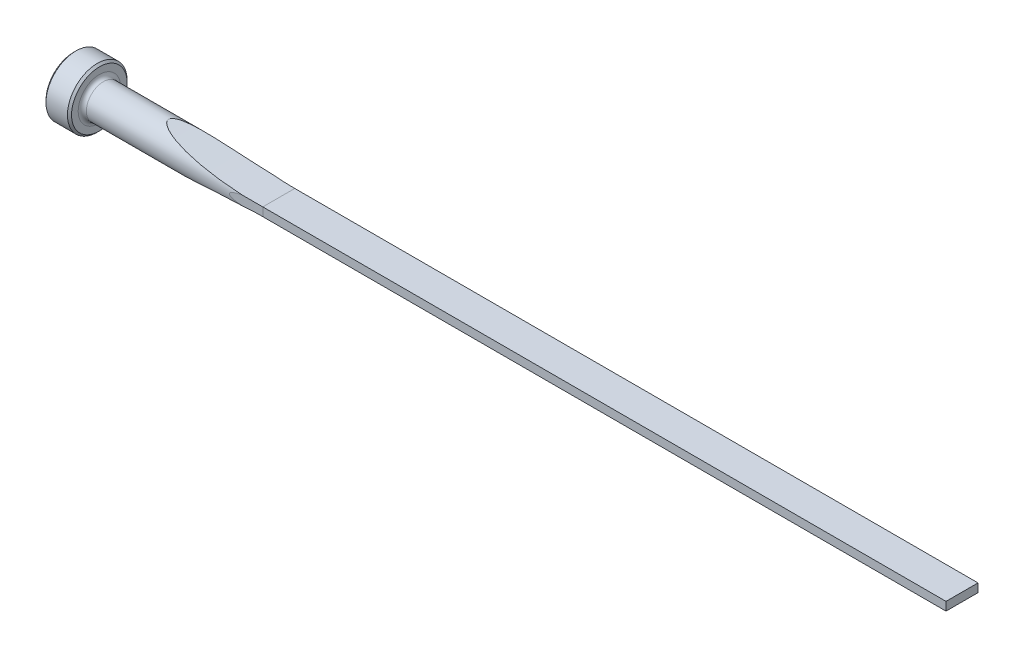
ISO-10303-21;
HEADER;
FILE_DESCRIPTION(('STEP AP214'),'2;1');
FILE_NAME('part.step','',(''),(''),'','','');
FILE_SCHEMA(('AUTOMOTIVE_DESIGN { 1 0 10303 214 1 1 1 1 }'));
ENDSEC;
DATA;
#1=APPLICATION_CONTEXT('core data for automotive mechanical design processes');
#2=APPLICATION_PROTOCOL_DEFINITION('international standard','automotive_design',2000,#1);
#3=PRODUCT_CONTEXT('',#1,'mechanical');
#4=PRODUCT('Part','Part','',(#3));
#5=PRODUCT_RELATED_PRODUCT_CATEGORY('part','',(#4));
#6=PRODUCT_DEFINITION_FORMATION('','',#4);
#7=PRODUCT_DEFINITION_CONTEXT('part definition',#1,'design');
#8=PRODUCT_DEFINITION('design','',#6,#7);
#9=PRODUCT_DEFINITION_SHAPE('','',#8);
#10=(LENGTH_UNIT() NAMED_UNIT(*) SI_UNIT(.MILLI.,.METRE.));
#11=(NAMED_UNIT(*) PLANE_ANGLE_UNIT() SI_UNIT($,.RADIAN.));
#12=(NAMED_UNIT(*) SI_UNIT($,.STERADIAN.) SOLID_ANGLE_UNIT());
#13=UNCERTAINTY_MEASURE_WITH_UNIT(LENGTH_MEASURE(1.E-05),#10,'distance_accuracy_value','');
#14=(GEOMETRIC_REPRESENTATION_CONTEXT(3) GLOBAL_UNCERTAINTY_ASSIGNED_CONTEXT((#13)) GLOBAL_UNIT_ASSIGNED_CONTEXT((#10,
#11,#12)) REPRESENTATION_CONTEXT('',''));
#15=CARTESIAN_POINT('',(0.,0.,0.));
#16=DIRECTION('',(0.,0.,1.));
#17=DIRECTION('',(1.,0.,0.));
#18=AXIS2_PLACEMENT_3D('',#15,#16,#17);
#19=CARTESIAN_POINT('',(0.,0.,0.));
#20=DIRECTION('',(-1.,0.,0.));
#21=DIRECTION('',(0.,0.,1.));
#22=AXIS2_PLACEMENT_3D('',#19,#20,#21);
#23=CYLINDRICAL_SURFACE('',#22,3.175);
#24=CARTESIAN_POINT('',(5.5118,0.,0.));
#25=DIRECTION('',(-1.,0.,0.));
#26=DIRECTION('',(0.,0.,1.));
#27=AXIS2_PLACEMENT_3D('',#24,#25,#26);
#28=CIRCLE('',#27,3.175);
#29=CARTESIAN_POINT('',(5.5118,0.,3.175));
#30=VERTEX_POINT('',#29);
#31=EDGE_CURVE('E153',#30,#30,#28,.F.);
#32=ORIENTED_EDGE('',*,*,#31,.T.);
#33=EDGE_LOOP('',(#32));
#34=FACE_BOUND('',#33,.T.);
#35=CARTESIAN_POINT('',(38.1,1.11760000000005,2.97179999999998));
#36=CARTESIAN_POINT('',(37.8357957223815,1.11753103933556,2.9717988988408));
#37=CARTESIAN_POINT('',(37.5715815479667,1.11446404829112,2.97297778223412));
#38=CARTESIAN_POINT('',(37.043191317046,1.10185346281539,2.97768913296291));
#39=CARTESIAN_POINT('',(36.7790153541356,1.09230645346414,2.98122284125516));
#40=CARTESIAN_POINT('',(36.2493837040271,1.06617269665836,2.9906669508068));
#41=CARTESIAN_POINT('',(35.983930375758,1.04954219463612,2.99659211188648));
#42=CARTESIAN_POINT('',(35.4537877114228,1.00807205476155,3.01079697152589));
#43=CARTESIAN_POINT('',(35.1890982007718,0.983234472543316,3.01907608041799));
#44=CARTESIAN_POINT('',(34.6615789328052,0.923383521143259,3.03792875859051));
#45=CARTESIAN_POINT('',(34.3987461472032,0.888396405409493,3.04849639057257));
#46=CARTESIAN_POINT('',(34.0064659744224,0.825064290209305,3.06600005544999));
#47=CARTESIAN_POINT('',(33.8761087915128,0.802161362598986,3.07210597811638));
#48=CARTESIAN_POINT('',(33.6163554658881,0.751700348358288,3.08484243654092));
#49=CARTESIAN_POINT('',(33.4869590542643,0.724143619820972,3.09147281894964));
#50=CARTESIAN_POINT('',(33.2294078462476,0.662714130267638,3.10522998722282));
#51=CARTESIAN_POINT('',(33.1012554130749,0.628831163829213,3.11235756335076));
#52=CARTESIAN_POINT('',(32.9111286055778,0.570760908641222,3.12333709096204));
#53=CARTESIAN_POINT('',(32.8480498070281,0.550175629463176,3.12704828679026));
#54=CARTESIAN_POINT('',(32.7230456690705,0.505797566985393,3.13453462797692));
#55=CARTESIAN_POINT('',(32.661119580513,0.482006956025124,3.13830972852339));
#56=CARTESIAN_POINT('',(32.5388265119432,0.429769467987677,3.1458898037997));
#57=CARTESIAN_POINT('',(32.4784713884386,0.401294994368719,3.14969481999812));
#58=CARTESIAN_POINT('',(32.361395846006,0.337410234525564,3.1571914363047));
#59=CARTESIAN_POINT('',(32.3046630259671,0.30202550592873,3.16088339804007));
#60=CARTESIAN_POINT('',(32.2318457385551,0.243613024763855,3.16568281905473));
#61=CARTESIAN_POINT('',(32.2116878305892,0.22579036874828,3.16701915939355));
#62=CARTESIAN_POINT('',(32.1741240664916,0.187442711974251,3.16952077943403));
#63=CARTESIAN_POINT('',(32.1567070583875,0.166929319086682,3.17068675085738));
#64=CARTESIAN_POINT('',(32.1335834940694,0.132884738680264,3.17224001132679));
#65=CARTESIAN_POINT('',(32.1261886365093,0.120518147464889,3.17273788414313));
#66=CARTESIAN_POINT('',(32.1132601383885,0.0948283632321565,3.1736095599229));
#67=CARTESIAN_POINT('',(32.1077252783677,0.0815058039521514,3.17398344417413));
#68=CARTESIAN_POINT('',(32.0990082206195,0.053897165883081,3.1745727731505));
#69=CARTESIAN_POINT('',(32.0958567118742,0.0396010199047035,3.17478615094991));
#70=CARTESIAN_POINT('',(32.0924789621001,0.0106696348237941,3.17501485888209));
#71=CARTESIAN_POINT('',(32.0922487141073,-0.00396511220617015,3.17503046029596));
#72=CARTESIAN_POINT('',(32.0945596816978,-0.0309283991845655,3.17487397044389));
#73=CARTESIAN_POINT('',(32.0967167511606,-0.0432925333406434,3.17472789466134));
#74=CARTESIAN_POINT('',(32.1029656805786,-0.0675187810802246,3.17430516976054));
#75=CARTESIAN_POINT('',(32.1070594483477,-0.0793803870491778,3.17402839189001));
#76=CARTESIAN_POINT('',(32.1191372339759,-0.107852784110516,3.17321302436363));
#77=CARTESIAN_POINT('',(32.1280454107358,-0.124065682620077,3.17261252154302));
#78=CARTESIAN_POINT('',(32.1482326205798,-0.154926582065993,3.17125564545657));
#79=CARTESIAN_POINT('',(32.1595181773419,-0.169570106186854,3.1704988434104));
#80=CARTESIAN_POINT('',(32.1944341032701,-0.209900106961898,3.16816531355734));
#81=CARTESIAN_POINT('',(32.2200991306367,-0.233790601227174,3.16645919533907));
#82=CARTESIAN_POINT('',(32.2742928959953,-0.277993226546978,3.1628833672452));
#83=CARTESIAN_POINT('',(32.302830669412,-0.298293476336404,3.16101314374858));
#84=CARTESIAN_POINT('',(32.3823413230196,-0.349789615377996,3.155843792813));
#85=CARTESIAN_POINT('',(32.4348887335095,-0.378519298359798,3.15247078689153));
#86=CARTESIAN_POINT('',(32.5423072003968,-0.431320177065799,3.1456765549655));
#87=CARTESIAN_POINT('',(32.5971839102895,-0.455379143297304,3.14225522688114));
#88=CARTESIAN_POINT('',(32.7085705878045,-0.500302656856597,3.13541729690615));
#89=CARTESIAN_POINT('',(32.765087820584,-0.521149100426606,3.13200082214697));
#90=CARTESIAN_POINT('',(32.8788979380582,-0.560302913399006,3.12523191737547));
#91=CARTESIAN_POINT('',(32.9361896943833,-0.578613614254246,3.12187940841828));
#92=CARTESIAN_POINT('',(33.1297297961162,-0.636913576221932,3.11074477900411));
#93=CARTESIAN_POINT('',(33.2673130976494,-0.672489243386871,3.10314401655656));
#94=CARTESIAN_POINT('',(33.5441302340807,-0.736755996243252,3.08850582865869));
#95=CARTESIAN_POINT('',(33.6833651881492,-0.765442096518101,3.0814688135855));
#96=CARTESIAN_POINT('',(33.9631295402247,-0.817784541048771,3.06799404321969));
#97=CARTESIAN_POINT('',(34.1036611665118,-0.841429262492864,3.06155769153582));
#98=CARTESIAN_POINT('',(34.3853732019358,-0.884713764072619,3.04932851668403));
#99=CARTESIAN_POINT('',(34.5265536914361,-0.904353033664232,3.04353577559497));
#100=CARTESIAN_POINT('',(34.9506897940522,-0.958348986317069,3.02714982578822));
#101=CARTESIAN_POINT('',(35.2343099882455,-0.987796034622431,3.01754551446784));
#102=CARTESIAN_POINT('',(35.802086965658,-1.03680456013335,3.00105004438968));
#103=CARTESIAN_POINT('',(36.0862426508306,-1.05637822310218,2.99415554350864));
#104=CARTESIAN_POINT('',(36.5149168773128,-1.079629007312,2.98581493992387));
#105=CARTESIAN_POINT('',(36.659256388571,-1.08638681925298,2.98335806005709));
#106=CARTESIAN_POINT('',(36.9480641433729,-1.0978849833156,2.97914616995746));
#107=CARTESIAN_POINT('',(37.0925324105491,-1.1026248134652,2.97739134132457));
#108=CARTESIAN_POINT('',(37.380840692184,-1.1101534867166,2.97459254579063));
#109=CARTESIAN_POINT('',(37.524680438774,-1.11295147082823,2.97354524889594));
#110=CARTESIAN_POINT('',(37.8123469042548,-1.11667170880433,2.97214903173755));
#111=CARTESIAN_POINT('',(37.9561736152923,-1.11759449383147,2.97179991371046));
#112=CARTESIAN_POINT('',(38.1,-1.11760000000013,2.97179999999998));
#113=B_SPLINE_CURVE_WITH_KNOTS('',3,(#35,#36,#37,#38,#39,#40,#41,#42,#43,#44,#45,#46,#47,#48,
#49,#50,#51,#52,#53,#54,#55,#56,#57,#58,#59,#60,#61,#62,#63,#64,#65,#66,#67,#68,#69,#70,#71,#72,
#73,#74,#75,#76,#77,#78,#79,#80,#81,#82,#83,#84,#85,#86,#87,#88,#89,#90,#91,#92,#93,#94,#95,#96,
#97,#98,#99,#100,#101,#102,#103,#104,#105,#106,#107,#108,#109,#110,#111,#112),.UNSPECIFIED.,.F.,
.F.,(4,2,2,2,2,2,2,2,2,2,2,2,2,2,2,2,2,2,2,2,2,2,2,2,2,2,2,2,2,2,2,2,2,2,2,2,2,2,4),(0.,
0.792608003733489,1.58563403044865,2.38363126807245,3.18142878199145,3.97718078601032,
4.37459807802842,4.77189959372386,5.16984765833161,5.36916585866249,5.56834964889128,
5.76875204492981,5.96842682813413,6.0490912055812,6.12941838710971,6.17255460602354,
6.21566248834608,6.2593164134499,6.30291045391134,6.34039079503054,6.37790813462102,
6.43311579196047,6.48847696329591,6.59320183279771,6.69826703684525,6.87774508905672,
7.05768691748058,7.23860836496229,7.41928981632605,7.84588397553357,8.27278590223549,
8.70066164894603,9.12859189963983,9.98423938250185,10.8388282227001,11.2723701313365,
11.7060241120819,12.1376226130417,12.569098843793),.UNSPECIFIED.);
#114=CARTESIAN_POINT('',(34.2853026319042,0.869282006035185,3.05368200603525));
#115=VERTEX_POINT('',#114);
#116=CARTESIAN_POINT('',(34.2853026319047,-0.869282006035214,3.05368200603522));
#117=VERTEX_POINT('',#116);
#118=EDGE_CURVE('E156',#115,#117,#113,.T.);
#119=ORIENTED_EDGE('',*,*,#118,.F.);
#120=CARTESIAN_POINT('',(38.1,0.78739999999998,3.07581310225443));
#121=CARTESIAN_POINT('',(37.8355438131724,0.787399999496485,3.07581083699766));
#122=CARTESIAN_POINT('',(37.5710891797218,0.788580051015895,3.07551132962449));
#123=CARTESIAN_POINT('',(37.0422022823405,0.793300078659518,3.07429803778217));
#124=CARTESIAN_POINT('',(36.7777700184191,0.796840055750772,3.0733842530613));
#125=CARTESIAN_POINT('',(35.9844189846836,0.811001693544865,3.0696912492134));
#126=CARTESIAN_POINT('',(35.4555630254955,0.825165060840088,3.06596036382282));
#127=CARTESIAN_POINT('',(34.3968502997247,0.862977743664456,3.05553241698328));
#128=CARTESIAN_POINT('',(33.8669944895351,0.88665153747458,3.04882769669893));
#129=CARTESIAN_POINT('',(32.8079603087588,0.943468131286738,3.03172836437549));
#130=CARTESIAN_POINT('',(32.2787818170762,0.976608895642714,3.02133454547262));
#131=CARTESIAN_POINT('',(31.2997492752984,1.04671882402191,2.99769210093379));
#132=CARTESIAN_POINT('',(30.8497861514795,1.0823884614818,2.98509669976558));
#133=CARTESIAN_POINT('',(29.9505791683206,1.16056445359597,2.9555818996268));
#134=CARTESIAN_POINT('',(29.5013353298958,1.203071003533,2.93866237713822));
#135=CARTESIAN_POINT('',(28.603288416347,1.29494318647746,2.89935313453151));
#136=CARTESIAN_POINT('',(28.1544863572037,1.34431625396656,2.8769574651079));
#137=CARTESIAN_POINT('',(27.2580959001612,1.44984136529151,2.82525115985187));
#138=CARTESIAN_POINT('',(26.8105074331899,1.50599301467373,2.79594092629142));
#139=CARTESIAN_POINT('',(25.9157511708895,1.62515896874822,2.72840404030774));
#140=CARTESIAN_POINT('',(25.4685873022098,1.68819027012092,2.69015502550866));
#141=CARTESIAN_POINT('',(24.5762278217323,1.82090442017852,2.6021747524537));
#142=CARTESIAN_POINT('',(24.1310327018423,1.8905888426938,2.55244077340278));
#143=CARTESIAN_POINT('',(23.4659910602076,1.99985162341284,2.46644191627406));
#144=CARTESIAN_POINT('',(23.2450024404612,2.03701989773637,2.43591445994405));
#145=CARTESIAN_POINT('',(22.8039601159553,2.11291046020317,2.37039160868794));
#146=CARTESIAN_POINT('',(22.5839063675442,2.1516326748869,2.33539642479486));
#147=CARTESIAN_POINT('',(22.1450648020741,2.23055506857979,2.26013733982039));
#148=CARTESIAN_POINT('',(21.9262764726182,2.27075459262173,2.21987575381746));
#149=CARTESIAN_POINT('',(21.4902406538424,2.35255542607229,2.13299737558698));
#150=CARTESIAN_POINT('',(21.2729929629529,2.39415654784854,2.0863814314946));
#151=CARTESIAN_POINT('',(20.9477545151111,2.45768704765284,2.01034767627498));
#152=CARTESIAN_POINT('',(20.8389864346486,2.4791456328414,1.98385903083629));
#153=CARTESIAN_POINT('',(20.6220867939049,2.52235662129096,1.92861783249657));
#154=CARTESIAN_POINT('',(20.5139552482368,2.54410903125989,1.89986522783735));
#155=CARTESIAN_POINT('',(20.1903801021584,2.6098257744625,1.80970323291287));
#156=CARTESIAN_POINT('',(19.9760432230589,2.65419348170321,1.74445519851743));
#157=CARTESIAN_POINT('',(19.6591981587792,2.72097915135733,1.63665429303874));
#158=CARTESIAN_POINT('',(19.55487364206,2.74316775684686,1.59927855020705));
#159=CARTESIAN_POINT('',(19.3477705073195,2.78760086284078,1.52051286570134));
#160=CARTESIAN_POINT('',(19.2449915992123,2.8098453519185,1.47912368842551));
#161=CARTESIAN_POINT('',(19.0417053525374,2.8542138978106,1.39157880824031));
#162=CARTESIAN_POINT('',(18.9411937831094,2.87633810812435,1.34543306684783));
#163=CARTESIAN_POINT('',(18.7430959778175,2.92029487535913,1.24716139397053));
#164=CARTESIAN_POINT('',(18.6455078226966,2.94212761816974,1.19503949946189));
#165=CARTESIAN_POINT('',(18.5117813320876,2.97227306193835,1.11659829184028));
#166=CARTESIAN_POINT('',(18.4738115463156,2.98085925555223,1.09349968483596));
#167=CARTESIAN_POINT('',(18.3987226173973,2.99788995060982,1.04590629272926));
#168=CARTESIAN_POINT('',(18.3616035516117,3.00633443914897,1.02141138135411));
#169=CARTESIAN_POINT('',(18.2515401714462,3.03144638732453,0.945421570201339));
#170=CARTESIAN_POINT('',(18.1801213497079,3.04784006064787,0.891554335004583));
#171=CARTESIAN_POINT('',(18.0427883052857,3.07952922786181,0.775133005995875));
#172=CARTESIAN_POINT('',(17.9769534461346,3.09480855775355,0.712479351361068));
#173=CARTESIAN_POINT('',(17.8563432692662,3.12292613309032,0.576813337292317));
#174=CARTESIAN_POINT('',(17.8015101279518,3.13577711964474,0.503858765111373));
#175=CARTESIAN_POINT('',(17.7334503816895,3.15177595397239,0.385387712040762));
#176=CARTESIAN_POINT('',(17.7130844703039,3.15657317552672,0.344236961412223));
#177=CARTESIAN_POINT('',(17.678672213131,3.16468806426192,0.25921672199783));
#178=CARTESIAN_POINT('',(17.6646188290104,3.16800737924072,0.215350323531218));
#179=CARTESIAN_POINT('',(17.6441287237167,3.1728494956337,0.12528752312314));
#180=CARTESIAN_POINT('',(17.6377647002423,3.17435514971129,0.0790731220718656));
#181=CARTESIAN_POINT('',(17.6337325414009,3.17530892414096,-0.0137573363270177));
#182=CARTESIAN_POINT('',(17.6360615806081,3.17475771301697,-0.0603732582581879));
#183=CARTESIAN_POINT('',(17.648420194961,3.17183542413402,-0.147654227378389));
#184=CARTESIAN_POINT('',(17.6576480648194,3.16965382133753,-0.188444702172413));
#185=CARTESIAN_POINT('',(17.6819667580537,3.16391143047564,-0.268119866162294));
#186=CARTESIAN_POINT('',(17.6970614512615,3.16034973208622,-0.307003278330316));
#187=CARTESIAN_POINT('',(17.741942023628,3.14977663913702,-0.403821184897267));
#188=CARTESIAN_POINT('',(17.7752036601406,3.14195464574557,-0.460042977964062));
#189=CARTESIAN_POINT('',(17.8496780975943,3.12449841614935,-0.566634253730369));
#190=CARTESIAN_POINT('',(17.8909151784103,3.11485864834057,-0.616985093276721));
#191=CARTESIAN_POINT('',(17.9763515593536,3.09496038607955,-0.709911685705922));
#192=CARTESIAN_POINT('',(18.0202749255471,3.08476245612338,-0.75275910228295));
#193=CARTESIAN_POINT('',(18.1115201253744,3.06365689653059,-0.834515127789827));
#194=CARTESIAN_POINT('',(18.1588452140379,3.05274858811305,-0.873419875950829));
#195=CARTESIAN_POINT('',(18.2560433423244,3.03043330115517,-0.947952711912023));
#196=CARTESIAN_POINT('',(18.3059217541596,3.0190252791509,-0.983573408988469));
#197=CARTESIAN_POINT('',(18.4074943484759,2.99588982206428,-1.05193545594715));
#198=CARTESIAN_POINT('',(18.4591877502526,2.98416252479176,-1.08467802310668));
#199=CARTESIAN_POINT('',(18.5974109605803,2.95293886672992,-1.16783092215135));
#200=CARTESIAN_POINT('',(18.6851310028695,2.93325796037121,-1.216190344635));
#201=CARTESIAN_POINT('',(18.8631864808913,2.89360215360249,-1.30773540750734));
#202=CARTESIAN_POINT('',(18.9535233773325,2.8736270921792,-1.35091808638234));
#203=CARTESIAN_POINT('',(19.1362397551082,2.83353099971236,-1.43311613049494));
#204=CARTESIAN_POINT('',(19.2286227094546,2.81340976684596,-1.47212362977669));
#205=CARTESIAN_POINT('',(19.4148168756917,2.77317207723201,-1.54658525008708));
#206=CARTESIAN_POINT('',(19.5086283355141,2.75305562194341,-1.58203874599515));
#207=CARTESIAN_POINT('',(19.7926824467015,2.69263186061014,-1.68424564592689));
#208=CARTESIAN_POINT('',(19.984601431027,2.65245744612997,-1.74643627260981));
#209=CARTESIAN_POINT('',(20.2744533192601,2.59279838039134,-1.83281823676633));
#210=CARTESIAN_POINT('',(20.371341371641,2.57302402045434,-1.86044719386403));
#211=CARTESIAN_POINT('',(20.5657197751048,2.53369185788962,-1.91366898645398));
#212=CARTESIAN_POINT('',(20.6632101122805,2.5141340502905,-1.93926186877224));
#213=CARTESIAN_POINT('',(20.9708756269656,2.45295213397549,-2.01698242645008));
#214=CARTESIAN_POINT('',(21.1819621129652,2.41176464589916,-2.06585236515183));
#215=CARTESIAN_POINT('',(21.6058251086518,2.33066711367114,-2.15692409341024));
#216=CARTESIAN_POINT('',(21.8186018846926,2.29075727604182,-2.19912480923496));
#217=CARTESIAN_POINT('',(22.2455328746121,2.21230068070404,-2.27803601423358));
#218=CARTESIAN_POINT('',(22.4596877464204,2.17375464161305,-2.31474364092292));
#219=CARTESIAN_POINT('',(22.8890012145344,2.09811389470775,-2.3835155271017));
#220=CARTESIAN_POINT('',(23.104159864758,2.06101926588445,-2.41557953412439));
#221=CARTESIAN_POINT('',(23.751863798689,1.95181443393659,-2.50600220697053));
#222=CARTESIAN_POINT('',(24.1856254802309,1.88196933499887,-2.55841192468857));
#223=CARTESIAN_POINT('',(25.0552081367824,1.74857514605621,-2.65135263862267));
#224=CARTESIAN_POINT('',(25.4910284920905,1.68502427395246,-2.69188700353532));
#225=CARTESIAN_POINT('',(26.3646050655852,1.56427552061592,-2.76380276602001));
#226=CARTESIAN_POINT('',(26.8023624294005,1.50708213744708,-2.7951777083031));
#227=CARTESIAN_POINT('',(27.6791511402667,1.39917293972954,-2.85072181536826));
#228=CARTESIAN_POINT('',(28.1181825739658,1.34845757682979,-2.87489047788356));
#229=CARTESIAN_POINT('',(28.996664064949,1.25361567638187,-2.91749372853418));
#230=CARTESIAN_POINT('',(29.4361128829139,1.20948085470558,-2.93593555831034));
#231=CARTESIAN_POINT('',(30.3157867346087,1.12775252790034,-2.96828666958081));
#232=CARTESIAN_POINT('',(30.7560117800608,1.09015912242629,-2.982195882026));
#233=CARTESIAN_POINT('',(31.7721267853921,1.01101466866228,-3.01010743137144));
#234=CARTESIAN_POINT('',(32.3482336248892,0.971783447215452,-3.02283110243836));
#235=CARTESIAN_POINT('',(33.5013377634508,0.904541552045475,-3.04362622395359));
#236=CARTESIAN_POINT('',(34.0783352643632,0.876533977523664,-3.05169638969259));
#237=CARTESIAN_POINT('',(35.2294207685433,0.831901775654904,-3.06416391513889));
#238=CARTESIAN_POINT('',(35.8035059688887,0.815211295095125,-3.06858255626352));
#239=CARTESIAN_POINT('',(36.6647116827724,0.798523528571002,-3.07294853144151));
#240=CARTESIAN_POINT('',(36.9517518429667,0.794352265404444,-3.07402686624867));
#241=CARTESIAN_POINT('',(37.5258606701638,0.788790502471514,-3.07545758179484));
#242=CARTESIAN_POINT('',(37.8129293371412,0.787400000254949,-3.07580996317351));
#243=CARTESIAN_POINT('',(38.1,0.787399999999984,-3.07581310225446));
#244=B_SPLINE_CURVE_WITH_KNOTS('',3,(#120,#121,#122,#123,#124,#125,#126,#127,#128,#129,#130,
#131,#132,#133,#134,#135,#136,#137,#138,#139,#140,#141,#142,#143,#144,#145,#146,#147,#148,#149,
#150,#151,#152,#153,#154,#155,#156,#157,#158,#159,#160,#161,#162,#163,#164,#165,#166,#167,#168,
#169,#170,#171,#172,#173,#174,#175,#176,#177,#178,#179,#180,#181,#182,#183,#184,#185,#186,#187,
#188,#189,#190,#191,#192,#193,#194,#195,#196,#197,#198,#199,#200,#201,#202,#203,#204,#205,#206,
#207,#208,#209,#210,#211,#212,#213,#214,#215,#216,#217,#218,#219,#220,#221,#222,#223,#224,#225,
#226,#227,#228,#229,#230,#231,#232,#233,#234,#235,#236,#237,#238,#239,#240,#241,#242,#243),
.UNSPECIFIED.,.F.,.F.,(4,2,2,2,2,2,2,2,2,2,2,2,2,2,2,2,2,2,2,2,2,2,2,2,2,2,2,2,2,2,2,2,2,2,2,2,
2,2,2,2,2,2,2,2,2,2,2,2,2,2,2,2,2,2,2,2,2,2,2,2,2,4),(0.,0.793362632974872,1.58672559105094,
3.17380261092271,4.76499095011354,6.35583739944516,7.71042211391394,9.0650455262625,
10.4211471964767,11.7771699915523,13.1366222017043,14.4963967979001,15.1748434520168,
15.8532580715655,16.5313754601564,17.2094024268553,17.5513342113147,17.8932738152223,
18.5780521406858,18.9170442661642,19.2559719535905,19.5942037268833,19.9322083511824,
20.0679784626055,20.2037608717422,20.4761399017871,20.7519011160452,21.0261726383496,
21.1642406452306,21.302154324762,21.4413619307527,21.5805242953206,21.705627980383,
21.8308143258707,22.0270516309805,22.2238960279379,22.4102246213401,22.5967339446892,
22.7836532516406,22.9704931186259,23.2765002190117,23.5826815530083,23.8894299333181,
24.1962321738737,24.8129775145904,25.1209844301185,25.4289842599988,26.0904791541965,
26.7520804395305,27.4140252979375,28.07600613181,29.40309776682,30.7298125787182,
32.0574601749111,33.3852002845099,34.7112545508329,36.0373290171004,37.769931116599,
39.5030113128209,41.2259182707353,42.087123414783,42.9483278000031),.UNSPECIFIED.);
#245=CARTESIAN_POINT('',(34.2853026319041,0.869282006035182,-3.05368200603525));
#246=VERTEX_POINT('',#245);
#247=EDGE_CURVE('E106',#115,#246,#244,.T.);
#248=ORIENTED_EDGE('',*,*,#247,.T.);
#249=CARTESIAN_POINT('',(38.1,1.11760000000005,-2.97179999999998));
#250=CARTESIAN_POINT('',(37.8357957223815,1.11753103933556,-2.9717988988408));
#251=CARTESIAN_POINT('',(37.5715815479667,1.11446404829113,-2.97297778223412));
#252=CARTESIAN_POINT('',(37.043191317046,1.10185346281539,-2.97768913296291));
#253=CARTESIAN_POINT('',(36.7790153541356,1.09230645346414,-2.98122284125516));
#254=CARTESIAN_POINT('',(36.2493837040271,1.06617269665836,-2.9906669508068));
#255=CARTESIAN_POINT('',(35.983930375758,1.04954219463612,-2.99659211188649));
#256=CARTESIAN_POINT('',(35.4537877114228,1.00807205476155,-3.01079697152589));
#257=CARTESIAN_POINT('',(35.1890982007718,0.983234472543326,-3.01907608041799));
#258=CARTESIAN_POINT('',(34.6615789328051,0.923383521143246,-3.03792875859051));
#259=CARTESIAN_POINT('',(34.3987461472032,0.888396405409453,-3.04849639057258));
#260=CARTESIAN_POINT('',(34.0064659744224,0.825064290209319,-3.06600005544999));
#261=CARTESIAN_POINT('',(33.8761087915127,0.802161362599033,-3.07210597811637));
#262=CARTESIAN_POINT('',(33.616355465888,0.751700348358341,-3.08484243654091));
#263=CARTESIAN_POINT('',(33.4869590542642,0.724143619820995,-3.09147281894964));
#264=CARTESIAN_POINT('',(33.2294078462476,0.662714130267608,-3.10522998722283));
#265=CARTESIAN_POINT('',(33.1012554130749,0.628831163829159,-3.11235756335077));
#266=CARTESIAN_POINT('',(32.9111286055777,0.57076090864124,-3.12333709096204));
#267=CARTESIAN_POINT('',(32.8480498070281,0.550175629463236,-3.12704828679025));
#268=CARTESIAN_POINT('',(32.7230456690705,0.50579756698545,-3.13453462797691));
#269=CARTESIAN_POINT('',(32.661119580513,0.482006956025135,-3.13830972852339));
#270=CARTESIAN_POINT('',(32.5388265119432,0.429769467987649,-3.14588980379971));
#271=CARTESIAN_POINT('',(32.4784713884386,0.401294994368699,-3.14969481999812));
#272=CARTESIAN_POINT('',(32.361395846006,0.337410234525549,-3.1571914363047));
#273=CARTESIAN_POINT('',(32.3046630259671,0.302025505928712,-3.16088339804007));
#274=CARTESIAN_POINT('',(32.2318457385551,0.243613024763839,-3.16568281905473));
#275=CARTESIAN_POINT('',(32.2116878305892,0.225790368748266,-3.16701915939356));
#276=CARTESIAN_POINT('',(32.1741240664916,0.187442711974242,-3.16952077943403));
#277=CARTESIAN_POINT('',(32.1567070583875,0.166929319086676,-3.17068675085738));
#278=CARTESIAN_POINT('',(32.1335834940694,0.132884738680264,-3.17224001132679));
#279=CARTESIAN_POINT('',(32.1261886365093,0.120518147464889,-3.17273788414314));
#280=CARTESIAN_POINT('',(32.1132601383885,0.0948283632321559,-3.1736095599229));
#281=CARTESIAN_POINT('',(32.1077252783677,0.0815058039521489,-3.17398344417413));
#282=CARTESIAN_POINT('',(32.0990082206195,0.0538971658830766,-3.1745727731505));
#283=CARTESIAN_POINT('',(32.0958567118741,0.0396010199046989,-3.17478615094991));
#284=CARTESIAN_POINT('',(32.0924789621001,0.0106696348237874,-3.17501485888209));
#285=CARTESIAN_POINT('',(32.0922487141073,-0.00396511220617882,-3.17503046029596));
#286=CARTESIAN_POINT('',(32.0945596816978,-0.0309283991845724,-3.17487397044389));
#287=CARTESIAN_POINT('',(32.0967167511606,-0.043292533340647,-3.17472789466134));
#288=CARTESIAN_POINT('',(32.1029656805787,-0.0675187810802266,-3.17430516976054));
#289=CARTESIAN_POINT('',(32.1070594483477,-0.0793803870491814,-3.17402839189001));
#290=CARTESIAN_POINT('',(32.1191372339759,-0.107852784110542,-3.17321302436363));
#291=CARTESIAN_POINT('',(32.1280454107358,-0.124065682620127,-3.17261252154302));
#292=CARTESIAN_POINT('',(32.1482326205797,-0.154926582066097,-3.17125564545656));
#293=CARTESIAN_POINT('',(32.1595181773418,-0.169570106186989,-3.17049884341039));
#294=CARTESIAN_POINT('',(32.19443410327,-0.209900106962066,-3.16816531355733));
#295=CARTESIAN_POINT('',(32.2200991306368,-0.233790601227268,-3.16645919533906));
#296=CARTESIAN_POINT('',(32.2742928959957,-0.277993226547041,-3.16288336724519));
#297=CARTESIAN_POINT('',(32.3028306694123,-0.298293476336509,-3.16101314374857));
#298=CARTESIAN_POINT('',(32.3823413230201,-0.349789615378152,-3.15584379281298));
#299=CARTESIAN_POINT('',(32.4348887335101,-0.378519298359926,-3.15247078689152));
#300=CARTESIAN_POINT('',(32.5423072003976,-0.431320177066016,-3.14567655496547));
#301=CARTESIAN_POINT('',(32.5971839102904,-0.455379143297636,-3.14225522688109));
#302=CARTESIAN_POINT('',(32.7085705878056,-0.500302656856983,-3.13541729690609));
#303=CARTESIAN_POINT('',(32.7650878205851,-0.52114910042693,-3.13200082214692));
#304=CARTESIAN_POINT('',(32.8788979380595,-0.56030291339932,-3.12523191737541));
#305=CARTESIAN_POINT('',(32.9361896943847,-0.578613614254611,-3.12187940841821));
#306=CARTESIAN_POINT('',(33.1297297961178,-0.63691357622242,-3.11074477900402));
#307=CARTESIAN_POINT('',(33.2673130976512,-0.672489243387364,-3.10314401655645));
#308=CARTESIAN_POINT('',(33.5441302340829,-0.73675599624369,-3.08850582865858));
#309=CARTESIAN_POINT('',(33.6833651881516,-0.765442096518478,-3.08146881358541));
#310=CARTESIAN_POINT('',(33.9631295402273,-0.817784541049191,-3.06799404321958));
#311=CARTESIAN_POINT('',(34.1036611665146,-0.841429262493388,-3.06155769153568));
#312=CARTESIAN_POINT('',(34.3853732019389,-0.884713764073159,-3.04932851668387));
#313=CARTESIAN_POINT('',(34.5265536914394,-0.904353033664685,-3.04353577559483));
#314=CARTESIAN_POINT('',(34.9506897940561,-0.958348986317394,-3.02714982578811));
#315=CARTESIAN_POINT('',(35.2343099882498,-0.987796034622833,-3.01754551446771));
#316=CARTESIAN_POINT('',(35.8020869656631,-1.0368045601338,-3.00105004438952));
#317=CARTESIAN_POINT('',(36.0862426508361,-1.05637822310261,-2.99415554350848));
#318=CARTESIAN_POINT('',(36.5149168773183,-1.0796290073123,-2.98581493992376));
#319=CARTESIAN_POINT('',(36.659256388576,-1.0863868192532,-2.98335806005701));
#320=CARTESIAN_POINT('',(36.948064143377,-1.09788498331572,-2.97914616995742));
#321=CARTESIAN_POINT('',(37.0925324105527,-1.10262481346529,-2.97739134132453));
#322=CARTESIAN_POINT('',(37.3808406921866,-1.11015348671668,-2.9745925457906));
#323=CARTESIAN_POINT('',(37.524680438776,-1.11295147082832,-2.97354524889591));
#324=CARTESIAN_POINT('',(37.8123469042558,-1.11667170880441,-2.97214903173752));
#325=CARTESIAN_POINT('',(37.9561736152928,-1.11759449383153,-2.97179991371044));
#326=CARTESIAN_POINT('',(38.1,-1.11760000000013,-2.97179999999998));
#327=B_SPLINE_CURVE_WITH_KNOTS('',3,(#249,#250,#251,#252,#253,#254,#255,#256,#257,#258,#259,
#260,#261,#262,#263,#264,#265,#266,#267,#268,#269,#270,#271,#272,#273,#274,#275,#276,#277,#278,
#279,#280,#281,#282,#283,#284,#285,#286,#287,#288,#289,#290,#291,#292,#293,#294,#295,#296,#297,
#298,#299,#300,#301,#302,#303,#304,#305,#306,#307,#308,#309,#310,#311,#312,#313,#314,#315,#316,
#317,#318,#319,#320,#321,#322,#323,#324,#325,#326),.UNSPECIFIED.,.F.,.F.,(4,2,2,2,2,2,2,2,2,2,2,
2,2,2,2,2,2,2,2,2,2,2,2,2,2,2,2,2,2,2,2,2,2,2,2,2,2,2,4),(0.,0.792608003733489,1.58563403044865,
2.38363126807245,3.18142878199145,3.97718078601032,4.37459807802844,4.77189959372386,
5.16984765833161,5.36916585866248,5.56834964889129,5.76875204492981,5.96842682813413,
6.04909120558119,6.12941838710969,6.17255460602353,6.21566248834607,6.25931641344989,
6.30291045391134,6.34039079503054,6.37790813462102,6.43311579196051,6.48847696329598,
6.59320183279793,6.69826703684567,6.87774508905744,7.05768691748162,7.23860836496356,
7.41928981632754,7.84588397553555,8.27278590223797,8.700661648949,9.12859189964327,
9.98423938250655,10.838828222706,11.272370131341,11.706024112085,12.1376226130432,
12.569098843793),.UNSPECIFIED.);
#328=CARTESIAN_POINT('',(34.2853026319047,-0.869282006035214,-3.05368200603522));
#329=VERTEX_POINT('',#328);
#330=EDGE_CURVE('E175',#246,#329,#327,.T.);
#331=ORIENTED_EDGE('',*,*,#330,.T.);
#332=CARTESIAN_POINT('',(38.1,-0.78739999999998,3.07581310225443));
#333=CARTESIAN_POINT('',(37.8355438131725,-0.787399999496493,3.07581083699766));
#334=CARTESIAN_POINT('',(37.5710891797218,-0.788580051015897,3.07551132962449));
#335=CARTESIAN_POINT('',(37.0422022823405,-0.793300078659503,3.07429803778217));
#336=CARTESIAN_POINT('',(36.7777700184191,-0.796840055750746,3.07338425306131));
#337=CARTESIAN_POINT('',(35.9844189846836,-0.811001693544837,3.06969124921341));
#338=CARTESIAN_POINT('',(35.4555630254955,-0.825165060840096,3.06596036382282));
#339=CARTESIAN_POINT('',(34.3968502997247,-0.862977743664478,3.05553241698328));
#340=CARTESIAN_POINT('',(33.8669944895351,-0.88665153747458,3.04882769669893));
#341=CARTESIAN_POINT('',(32.8079603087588,-0.943468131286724,3.03172836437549));
#342=CARTESIAN_POINT('',(32.2787818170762,-0.976608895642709,3.02133454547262));
#343=CARTESIAN_POINT('',(31.2997492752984,-1.04671882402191,2.99769210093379));
#344=CARTESIAN_POINT('',(30.8497861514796,-1.0823884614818,2.98509669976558));
#345=CARTESIAN_POINT('',(29.9505791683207,-1.16056445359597,2.9555818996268));
#346=CARTESIAN_POINT('',(29.5013353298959,-1.203071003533,2.93866237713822));
#347=CARTESIAN_POINT('',(28.603288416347,-1.29494318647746,2.89935313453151));
#348=CARTESIAN_POINT('',(28.1544863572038,-1.34431625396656,2.8769574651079));
#349=CARTESIAN_POINT('',(27.2580959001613,-1.44984136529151,2.82525115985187));
#350=CARTESIAN_POINT('',(26.8105074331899,-1.50599301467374,2.79594092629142));
#351=CARTESIAN_POINT('',(25.9157511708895,-1.62515896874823,2.72840404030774));
#352=CARTESIAN_POINT('',(25.4685873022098,-1.68819027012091,2.69015502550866));
#353=CARTESIAN_POINT('',(24.5762278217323,-1.82090442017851,2.6021747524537));
#354=CARTESIAN_POINT('',(24.1310327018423,-1.89058884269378,2.55244077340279));
#355=CARTESIAN_POINT('',(23.4659910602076,-1.99985162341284,2.46644191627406));
#356=CARTESIAN_POINT('',(23.2450024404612,-2.03701989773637,2.43591445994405));
#357=CARTESIAN_POINT('',(22.8039601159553,-2.11291046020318,2.37039160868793));
#358=CARTESIAN_POINT('',(22.5839063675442,-2.15163267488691,2.33539642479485));
#359=CARTESIAN_POINT('',(22.1450648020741,-2.2305550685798,2.26013733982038));
#360=CARTESIAN_POINT('',(21.9262764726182,-2.27075459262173,2.21987575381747));
#361=CARTESIAN_POINT('',(21.4902406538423,-2.35255542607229,2.13299737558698));
#362=CARTESIAN_POINT('',(21.2729929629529,-2.39415654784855,2.08638143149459));
#363=CARTESIAN_POINT('',(20.9477545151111,-2.45768704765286,2.01034767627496));
#364=CARTESIAN_POINT('',(20.8389864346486,-2.47914563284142,1.98385903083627));
#365=CARTESIAN_POINT('',(20.6220867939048,-2.52235662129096,1.92861783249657));
#366=CARTESIAN_POINT('',(20.5139552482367,-2.54410903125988,1.89986522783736));
#367=CARTESIAN_POINT('',(20.1903801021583,-2.60982577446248,1.80970323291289));
#368=CARTESIAN_POINT('',(19.9760432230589,-2.65419348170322,1.74445519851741));
#369=CARTESIAN_POINT('',(19.6591981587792,-2.72097915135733,1.63665429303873));
#370=CARTESIAN_POINT('',(19.55487364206,-2.74316775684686,1.59927855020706));
#371=CARTESIAN_POINT('',(19.3477705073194,-2.78760086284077,1.52051286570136));
#372=CARTESIAN_POINT('',(19.2449915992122,-2.80984535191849,1.47912368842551));
#373=CARTESIAN_POINT('',(19.0417053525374,-2.8542138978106,1.3915788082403));
#374=CARTESIAN_POINT('',(18.9411937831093,-2.87633810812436,1.34543306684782));
#375=CARTESIAN_POINT('',(18.7430959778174,-2.92029487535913,1.24716139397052));
#376=CARTESIAN_POINT('',(18.6455078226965,-2.94212761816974,1.19503949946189));
#377=CARTESIAN_POINT('',(18.5117813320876,-2.97227306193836,1.11659829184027));
#378=CARTESIAN_POINT('',(18.4738115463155,-2.98085925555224,1.09349968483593));
#379=CARTESIAN_POINT('',(18.3987226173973,-2.99788995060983,1.04590629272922));
#380=CARTESIAN_POINT('',(18.3616035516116,-3.00633443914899,1.02141138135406));
#381=CARTESIAN_POINT('',(18.2515401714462,-3.03144638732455,0.94542157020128));
#382=CARTESIAN_POINT('',(18.1801213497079,-3.04784006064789,0.891554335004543));
#383=CARTESIAN_POINT('',(18.0427883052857,-3.07952922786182,0.775133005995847));
#384=CARTESIAN_POINT('',(17.9769534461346,-3.09480855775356,0.712479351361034));
#385=CARTESIAN_POINT('',(17.8563432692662,-3.12292613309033,0.576813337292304));
#386=CARTESIAN_POINT('',(17.8015101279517,-3.13577711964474,0.503858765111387));
#387=CARTESIAN_POINT('',(17.7334503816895,-3.15177595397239,0.385387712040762));
#388=CARTESIAN_POINT('',(17.7130844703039,-3.15657317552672,0.344236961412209));
#389=CARTESIAN_POINT('',(17.678672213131,-3.16468806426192,0.259216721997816));
#390=CARTESIAN_POINT('',(17.6646188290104,-3.16800737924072,0.215350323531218));
#391=CARTESIAN_POINT('',(17.6441287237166,-3.1728494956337,0.125287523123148));
#392=CARTESIAN_POINT('',(17.6377647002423,-3.17435514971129,0.0790731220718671));
#393=CARTESIAN_POINT('',(17.633732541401,-3.17530892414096,-0.0137573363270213));
#394=CARTESIAN_POINT('',(17.6360615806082,-3.17475771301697,-0.0603732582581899));
#395=CARTESIAN_POINT('',(17.648420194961,-3.17183542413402,-0.147654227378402));
#396=CARTESIAN_POINT('',(17.6576480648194,-3.16965382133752,-0.188444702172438));
#397=CARTESIAN_POINT('',(17.6819667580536,-3.16391143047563,-0.268119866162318));
#398=CARTESIAN_POINT('',(17.6970614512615,-3.16034973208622,-0.307003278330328));
#399=CARTESIAN_POINT('',(17.741942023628,-3.14977663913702,-0.403821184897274));
#400=CARTESIAN_POINT('',(17.7752036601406,-3.14195464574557,-0.46004297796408));
#401=CARTESIAN_POINT('',(17.8496780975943,-3.12449841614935,-0.566634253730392));
#402=CARTESIAN_POINT('',(17.8909151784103,-3.11485864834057,-0.616985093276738));
#403=CARTESIAN_POINT('',(17.9763515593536,-3.09496038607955,-0.709911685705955));
#404=CARTESIAN_POINT('',(18.0202749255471,-3.08476245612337,-0.752759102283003));
#405=CARTESIAN_POINT('',(18.1115201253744,-3.06365689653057,-0.834515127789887));
#406=CARTESIAN_POINT('',(18.1588452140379,-3.05274858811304,-0.873419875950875));
#407=CARTESIAN_POINT('',(18.2560433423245,-3.03043330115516,-0.947952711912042));
#408=CARTESIAN_POINT('',(18.3059217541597,-3.0190252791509,-0.983573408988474));
#409=CARTESIAN_POINT('',(18.407494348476,-2.99588982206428,-1.05193545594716));
#410=CARTESIAN_POINT('',(18.4591877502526,-2.98416252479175,-1.08467802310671));
#411=CARTESIAN_POINT('',(18.5974109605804,-2.9529388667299,-1.16783092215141));
#412=CARTESIAN_POINT('',(18.6851310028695,-2.93325796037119,-1.21619034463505));
#413=CARTESIAN_POINT('',(18.8631864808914,-2.89360215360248,-1.30773540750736));
#414=CARTESIAN_POINT('',(18.9535233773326,-2.8736270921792,-1.35091808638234));
#415=CARTESIAN_POINT('',(19.1362397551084,-2.83353099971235,-1.43311613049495));
#416=CARTESIAN_POINT('',(19.2286227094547,-2.81340976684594,-1.47212362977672));
#417=CARTESIAN_POINT('',(19.4148168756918,-2.77317207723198,-1.54658525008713));
#418=CARTESIAN_POINT('',(19.5086283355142,-2.75305562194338,-1.5820387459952));
#419=CARTESIAN_POINT('',(19.7926824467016,-2.6926318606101,-1.68424564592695));
#420=CARTESIAN_POINT('',(19.9846014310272,-2.65245744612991,-1.7464362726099));
#421=CARTESIAN_POINT('',(20.2744533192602,-2.59279838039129,-1.83281823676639));
#422=CARTESIAN_POINT('',(20.3713413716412,-2.5730240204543,-1.86044719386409));
#423=CARTESIAN_POINT('',(20.565719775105,-2.53369185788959,-1.91366898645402));
#424=CARTESIAN_POINT('',(20.6632101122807,-2.51413405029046,-1.93926186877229));
#425=CARTESIAN_POINT('',(20.9708756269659,-2.45295213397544,-2.01698242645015));
#426=CARTESIAN_POINT('',(21.1819621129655,-2.4117646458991,-2.0658523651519));
#427=CARTESIAN_POINT('',(21.6058251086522,-2.33066711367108,-2.15692409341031));
#428=CARTESIAN_POINT('',(21.8186018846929,-2.29075727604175,-2.19912480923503));
#429=CARTESIAN_POINT('',(22.2455328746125,-2.21230068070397,-2.27803601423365));
#430=CARTESIAN_POINT('',(22.4596877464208,-2.17375464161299,-2.31474364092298));
#431=CARTESIAN_POINT('',(22.8890012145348,-2.09811389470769,-2.38351552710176));
#432=CARTESIAN_POINT('',(23.1041598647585,-2.06101926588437,-2.41557953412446));
#433=CARTESIAN_POINT('',(23.7518637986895,-1.95181443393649,-2.50600220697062));
#434=CARTESIAN_POINT('',(24.1856254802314,-1.88196933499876,-2.55841192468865));
#435=CARTESIAN_POINT('',(25.0552081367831,-1.7485751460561,-2.65135263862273));
#436=CARTESIAN_POINT('',(25.4910284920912,-1.68502427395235,-2.69188700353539));
#437=CARTESIAN_POINT('',(26.364605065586,-1.56427552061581,-2.76380276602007));
#438=CARTESIAN_POINT('',(26.8023624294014,-1.50708213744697,-2.79517770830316));
#439=CARTESIAN_POINT('',(27.6791511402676,-1.39917293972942,-2.85072181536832));
#440=CARTESIAN_POINT('',(28.1181825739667,-1.34845757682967,-2.87489047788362));
#441=CARTESIAN_POINT('',(28.99666406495,-1.25361567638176,-2.91749372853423));
#442=CARTESIAN_POINT('',(29.436112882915,-1.20948085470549,-2.93593555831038));
#443=CARTESIAN_POINT('',(30.3157867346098,-1.12775252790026,-2.96828666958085));
#444=CARTESIAN_POINT('',(30.756011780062,-1.09015912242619,-2.98219588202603));
#445=CARTESIAN_POINT('',(31.7721267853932,-1.01101466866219,-3.01010743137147));
#446=CARTESIAN_POINT('',(32.3482336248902,-0.971783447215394,-3.02283110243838));
#447=CARTESIAN_POINT('',(33.5013377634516,-0.904541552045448,-3.04362622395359));
#448=CARTESIAN_POINT('',(34.0783352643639,-0.876533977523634,-3.0516963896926));
#449=CARTESIAN_POINT('',(35.2294207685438,-0.831901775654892,-3.06416391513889));
#450=CARTESIAN_POINT('',(35.8035059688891,-0.815211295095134,-3.06858255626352));
#451=CARTESIAN_POINT('',(36.6647116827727,-0.798523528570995,-3.07294853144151));
#452=CARTESIAN_POINT('',(36.9517518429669,-0.794352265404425,-3.07402686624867));
#453=CARTESIAN_POINT('',(37.5258606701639,-0.788790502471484,-3.07545758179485));
#454=CARTESIAN_POINT('',(37.8129293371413,-0.787400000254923,-3.07580996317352));
#455=CARTESIAN_POINT('',(38.1,-0.787399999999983,-3.07581310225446));
#456=B_SPLINE_CURVE_WITH_KNOTS('',3,(#332,#333,#334,#335,#336,#337,#338,#339,#340,#341,#342,
#343,#344,#345,#346,#347,#348,#349,#350,#351,#352,#353,#354,#355,#356,#357,#358,#359,#360,#361,
#362,#363,#364,#365,#366,#367,#368,#369,#370,#371,#372,#373,#374,#375,#376,#377,#378,#379,#380,
#381,#382,#383,#384,#385,#386,#387,#388,#389,#390,#391,#392,#393,#394,#395,#396,#397,#398,#399,
#400,#401,#402,#403,#404,#405,#406,#407,#408,#409,#410,#411,#412,#413,#414,#415,#416,#417,#418,
#419,#420,#421,#422,#423,#424,#425,#426,#427,#428,#429,#430,#431,#432,#433,#434,#435,#436,#437,
#438,#439,#440,#441,#442,#443,#444,#445,#446,#447,#448,#449,#450,#451,#452,#453,#454,#455),
.UNSPECIFIED.,.F.,.F.,(4,2,2,2,2,2,2,2,2,2,2,2,2,2,2,2,2,2,2,2,2,2,2,2,2,2,2,2,2,2,2,2,2,2,2,2,
2,2,2,2,2,2,2,2,2,2,2,2,2,2,2,2,2,2,2,2,2,2,2,2,2,4),(0.,0.793362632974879,1.58672559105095,
3.17380261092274,4.76499095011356,6.35583739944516,7.71042211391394,9.0650455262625,
10.4211471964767,11.7771699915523,13.1366222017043,14.4963967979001,15.1748434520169,
15.8532580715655,16.5313754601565,17.2094024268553,17.5513342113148,17.8932738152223,
18.5780521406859,18.9170442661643,19.2559719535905,19.5942037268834,19.9322083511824,
20.0679784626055,20.2037608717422,20.4761399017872,20.7519011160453,21.0261726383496,
21.1642406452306,21.302154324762,21.4413619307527,21.5805242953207,21.705627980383,
21.8308143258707,22.0270516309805,22.223896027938,22.4102246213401,22.5967339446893,
22.7836532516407,22.970493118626,23.2765002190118,23.5826815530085,23.8894299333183,
24.1962321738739,24.8129775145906,25.1209844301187,25.4289842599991,26.0904791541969,
26.752080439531,27.414025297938,28.0760061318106,29.4030977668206,30.729812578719,
32.0574601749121,33.3852002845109,34.711254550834,36.0373290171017,37.7699311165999,
39.5030113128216,41.2259182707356,42.0871234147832,42.9483278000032),.UNSPECIFIED.);
#457=EDGE_CURVE('E105',#117,#329,#456,.T.);
#458=ORIENTED_EDGE('',*,*,#457,.F.);
#459=EDGE_LOOP('',(#119,#248,#331,#458));
#460=FACE_BOUND('',#459,.T.);
#461=ADVANCED_FACE('F33',(#34,#460),#23,.T.);
#462=CARTESIAN_POINT('',(165.1,3.175,0.));
#463=DIRECTION('',(-1.,0.,0.));
#464=DIRECTION('',(0.,0.,1.));
#465=AXIS2_PLACEMENT_3D('',#462,#463,#464);
#466=PLANE('',#465);
#467=DIRECTION('',(0.,1.,0.));
#468=VECTOR('',#467,1.);
#469=CARTESIAN_POINT('',(165.1,-5.5499,2.9718));
#470=LINE('',#469,#468);
#471=CARTESIAN_POINT('',(165.1,-0.7874,2.9718));
#472=VERTEX_POINT('',#471);
#473=CARTESIAN_POINT('',(165.1,0.7874,2.9718));
#474=VERTEX_POINT('',#473);
#475=EDGE_CURVE('E87',#472,#474,#470,.T.);
#476=ORIENTED_EDGE('',*,*,#475,.F.);
#477=DIRECTION('',(0.,0.,1.));
#478=VECTOR('',#477,1.);
#479=CARTESIAN_POINT('',(165.1,-0.7874,0.));
#480=LINE('',#479,#478);
#481=CARTESIAN_POINT('',(165.1,-0.7874,-2.97179999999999));
#482=VERTEX_POINT('',#481);
#483=EDGE_CURVE('E100',#482,#472,#480,.T.);
#484=ORIENTED_EDGE('',*,*,#483,.F.);
#485=DIRECTION('',(0.,1.,0.));
#486=VECTOR('',#485,1.);
#487=CARTESIAN_POINT('',(165.1,-5.5499,-2.9718));
#488=LINE('',#487,#486);
#489=CARTESIAN_POINT('',(165.1,0.787399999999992,-2.9718));
#490=VERTEX_POINT('',#489);
#491=EDGE_CURVE('E56',#482,#490,#488,.T.);
#492=ORIENTED_EDGE('',*,*,#491,.T.);
#493=DIRECTION('',(0.,0.,1.));
#494=VECTOR('',#493,1.);
#495=CARTESIAN_POINT('',(165.1,0.7874,0.));
#496=LINE('',#495,#494);
#497=EDGE_CURVE('E102',#490,#474,#496,.T.);
#498=ORIENTED_EDGE('',*,*,#497,.T.);
#499=EDGE_LOOP('',(#476,#484,#492,#498));
#500=FACE_BOUND('',#499,.T.);
#501=ADVANCED_FACE('F99',(#500),#466,.F.);
#502=CARTESIAN_POINT('',(38.1,89.6874,-5.5499));
#503=DIRECTION('',(0.,0.,1.));
#504=DIRECTION('',(1.,0.,0.));
#505=AXIS2_PLACEMENT_3D('',#502,#503,#504);
#506=CYLINDRICAL_SURFACE('',#505,88.9);
#507=CARTESIAN_POINT('',(38.1,89.6874,91.8718));
#508=DIRECTION('',(0.,-0.707106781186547,0.707106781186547));
#509=DIRECTION('',(0.,0.707106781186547,0.707106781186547));
#510=AXIS2_PLACEMENT_3D('',#507,#508,#509);
#511=ELLIPSE('',#510,125.723585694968,88.9);
#512=CARTESIAN_POINT('',(38.1,0.787399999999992,2.97179999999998));
#513=VERTEX_POINT('',#512);
#514=EDGE_CURVE('E162',#513,#115,#511,.F.);
#515=ORIENTED_EDGE('',*,*,#514,.F.);
#516=DIRECTION('',(0.,0.,1.));
#517=VECTOR('',#516,1.);
#518=CARTESIAN_POINT('',(38.1,0.787399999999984,-5.5499));
#519=LINE('',#518,#517);
#520=CARTESIAN_POINT('',(38.1,0.787399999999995,-2.97179999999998));
#521=VERTEX_POINT('',#520);
#522=EDGE_CURVE('E170',#521,#513,#519,.T.);
#523=ORIENTED_EDGE('',*,*,#522,.F.);
#524=CARTESIAN_POINT('',(38.1,89.6874,-91.8718));
#525=DIRECTION('',(0.,0.707106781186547,0.707106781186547));
#526=DIRECTION('',(0.,-0.707106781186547,0.707106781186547));
#527=AXIS2_PLACEMENT_3D('',#524,#525,#526);
#528=ELLIPSE('',#527,125.723585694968,88.9);
#529=EDGE_CURVE('E169',#521,#246,#528,.F.);
#530=ORIENTED_EDGE('',*,*,#529,.T.);
#531=ORIENTED_EDGE('',*,*,#247,.F.);
#532=EDGE_LOOP('',(#515,#523,#530,#531));
#533=FACE_BOUND('',#532,.T.);
#534=ADVANCED_FACE('F138',(#533),#506,.F.);
#535=CARTESIAN_POINT('',(165.1,0.7874,-5.5499));
#536=DIRECTION('',(0.,-1.,0.));
#537=DIRECTION('',(1.,0.,0.));
#538=AXIS2_PLACEMENT_3D('',#535,#536,#537);
#539=PLANE('',#538);
#540=DIRECTION('',(-1.,0.,0.));
#541=VECTOR('',#540,1.);
#542=CARTESIAN_POINT('',(165.1,0.7874,2.9718));
#543=LINE('',#542,#541);
#544=EDGE_CURVE('E188',#474,#513,#543,.T.);
#545=ORIENTED_EDGE('',*,*,#544,.F.);
#546=ORIENTED_EDGE('',*,*,#497,.F.);
#547=DIRECTION('',(-1.,0.,0.));
#548=VECTOR('',#547,1.);
#549=CARTESIAN_POINT('',(165.1,0.7874,-2.9718));
#550=LINE('',#549,#548);
#551=EDGE_CURVE('E174',#490,#521,#550,.T.);
#552=ORIENTED_EDGE('',*,*,#551,.T.);
#553=ORIENTED_EDGE('',*,*,#522,.T.);
#554=EDGE_LOOP('',(#545,#546,#552,#553));
#555=FACE_BOUND('',#554,.T.);
#556=ADVANCED_FACE('F129',(#555),#539,.F.);
#557=CARTESIAN_POINT('',(38.1,-89.6874,-5.5499));
#558=DIRECTION('',(0.,0.,1.));
#559=DIRECTION('',(1.,0.,0.));
#560=AXIS2_PLACEMENT_3D('',#557,#558,#559);
#561=CYLINDRICAL_SURFACE('',#560,88.9);
#562=DIRECTION('',(0.,0.,1.));
#563=VECTOR('',#562,1.);
#564=CARTESIAN_POINT('',(38.1,-0.787399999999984,-5.5499));
#565=LINE('',#564,#563);
#566=CARTESIAN_POINT('',(38.1,-0.787399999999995,-2.97179999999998));
#567=VERTEX_POINT('',#566);
#568=CARTESIAN_POINT('',(38.1,-0.787399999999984,2.97179999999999));
#569=VERTEX_POINT('',#568);
#570=EDGE_CURVE('E178',#567,#569,#565,.T.);
#571=ORIENTED_EDGE('',*,*,#570,.T.);
#572=CARTESIAN_POINT('',(38.1,-89.6874,91.8718));
#573=DIRECTION('',(0.,0.707106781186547,0.707106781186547));
#574=DIRECTION('',(0.,-0.707106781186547,0.707106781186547));
#575=AXIS2_PLACEMENT_3D('',#572,#573,#574);
#576=ELLIPSE('',#575,125.723585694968,88.9);
#577=EDGE_CURVE('E163',#569,#117,#576,.T.);
#578=ORIENTED_EDGE('',*,*,#577,.T.);
#579=ORIENTED_EDGE('',*,*,#457,.T.);
#580=CARTESIAN_POINT('',(38.1,-89.6874,-91.8718));
#581=DIRECTION('',(0.,-0.707106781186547,0.707106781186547));
#582=DIRECTION('',(0.,0.707106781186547,0.707106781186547));
#583=AXIS2_PLACEMENT_3D('',#580,#581,#582);
#584=ELLIPSE('',#583,125.723585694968,88.9);
#585=EDGE_CURVE('E180',#567,#329,#584,.T.);
#586=ORIENTED_EDGE('',*,*,#585,.F.);
#587=EDGE_LOOP('',(#571,#578,#579,#586));
#588=FACE_BOUND('',#587,.T.);
#589=ADVANCED_FACE('F124',(#588),#561,.F.);
#590=CARTESIAN_POINT('',(165.1,-0.7874,-5.5499));
#591=DIRECTION('',(0.,-1.,0.));
#592=DIRECTION('',(1.,0.,0.));
#593=AXIS2_PLACEMENT_3D('',#590,#591,#592);
#594=PLANE('',#593);
#595=ORIENTED_EDGE('',*,*,#483,.T.);
#596=DIRECTION('',(-1.,0.,0.));
#597=VECTOR('',#596,1.);
#598=CARTESIAN_POINT('',(165.1,-0.7874,2.9718));
#599=LINE('',#598,#597);
#600=EDGE_CURVE('E84',#472,#569,#599,.T.);
#601=ORIENTED_EDGE('',*,*,#600,.T.);
#602=ORIENTED_EDGE('',*,*,#570,.F.);
#603=DIRECTION('',(-1.,0.,0.));
#604=VECTOR('',#603,1.);
#605=CARTESIAN_POINT('',(165.1,-0.7874,-2.9718));
#606=LINE('',#605,#604);
#607=EDGE_CURVE('E94',#482,#567,#606,.T.);
#608=ORIENTED_EDGE('',*,*,#607,.F.);
#609=EDGE_LOOP('',(#595,#601,#602,#608));
#610=FACE_BOUND('',#609,.T.);
#611=ADVANCED_FACE('F104',(#610),#594,.T.);
#612=CARTESIAN_POINT('',(0.,0.,0.));
#613=DIRECTION('',(1.,0.,0.));
#614=DIRECTION('',(0.,0.,-1.));
#615=AXIS2_PLACEMENT_3D('',#612,#613,#614);
#616=PLANE('',#615);
#617=CARTESIAN_POINT('',(0.,0.,0.));
#618=DIRECTION('',(1.,0.,0.));
#619=DIRECTION('',(0.,0.,-1.));
#620=AXIS2_PLACEMENT_3D('',#617,#618,#619);
#621=CIRCLE('',#620,5.16889999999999);
#622=CARTESIAN_POINT('',(0.,0.,-5.16889999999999));
#623=VERTEX_POINT('',#622);
#624=EDGE_CURVE('E239',#623,#623,#621,.F.);
#625=ORIENTED_EDGE('',*,*,#624,.T.);
#626=EDGE_LOOP('',(#625));
#627=FACE_BOUND('',#626,.T.);
#628=ADVANCED_FACE('F136',(#627),#616,.F.);
#629=CARTESIAN_POINT('',(0.,0.,0.));
#630=DIRECTION('',(-1.,0.,0.));
#631=DIRECTION('',(0.,0.,1.));
#632=AXIS2_PLACEMENT_3D('',#629,#630,#631);
#633=CYLINDRICAL_SURFACE('',#632,5.5499);
#634=CARTESIAN_POINT('',(0.381000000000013,0.,0.));
#635=DIRECTION('',(1.,0.,0.));
#636=DIRECTION('',(0.,0.,-1.));
#637=AXIS2_PLACEMENT_3D('',#634,#635,#636);
#638=CIRCLE('',#637,5.5499);
#639=CARTESIAN_POINT('',(0.381000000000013,0.,-5.5499));
#640=VERTEX_POINT('',#639);
#641=EDGE_CURVE('E41',#640,#640,#638,.T.);
#642=ORIENTED_EDGE('',*,*,#641,.T.);
#643=EDGE_LOOP('',(#642));
#644=FACE_BOUND('',#643,.T.);
#645=CARTESIAN_POINT('',(4.36880000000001,0.,0.));
#646=DIRECTION('',(-1.,0.,0.));
#647=DIRECTION('',(0.,0.,1.));
#648=AXIS2_PLACEMENT_3D('',#645,#646,#647);
#649=CIRCLE('',#648,5.5499);
#650=CARTESIAN_POINT('',(4.36880000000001,0.,5.5499));
#651=VERTEX_POINT('',#650);
#652=EDGE_CURVE('E240',#651,#651,#649,.T.);
#653=ORIENTED_EDGE('',*,*,#652,.T.);
#654=EDGE_LOOP('',(#653));
#655=FACE_BOUND('',#654,.T.);
#656=ADVANCED_FACE('F213',(#644,#655),#633,.T.);
#657=CARTESIAN_POINT('',(4.7498,5.5499,0.));
#658=DIRECTION('',(-1.,0.,0.));
#659=DIRECTION('',(0.,0.,1.));
#660=AXIS2_PLACEMENT_3D('',#657,#658,#659);
#661=PLANE('',#660);
#662=CARTESIAN_POINT('',(4.7498,0.,0.));
#663=DIRECTION('',(-1.,0.,0.));
#664=DIRECTION('',(0.,0.,1.));
#665=AXIS2_PLACEMENT_3D('',#662,#663,#664);
#666=CIRCLE('',#665,5.16890000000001);
#667=CARTESIAN_POINT('',(4.7498,0.,5.16890000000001));
#668=VERTEX_POINT('',#667);
#669=EDGE_CURVE('E11',#668,#668,#666,.F.);
#670=ORIENTED_EDGE('',*,*,#669,.T.);
#671=EDGE_LOOP('',(#670));
#672=FACE_BOUND('',#671,.T.);
#673=CARTESIAN_POINT('',(4.7498,0.,0.));
#674=DIRECTION('',(-1.,0.,0.));
#675=DIRECTION('',(0.,0.,1.));
#676=AXIS2_PLACEMENT_3D('',#673,#674,#675);
#677=CIRCLE('',#676,3.937);
#678=CARTESIAN_POINT('',(4.7498,0.,3.937));
#679=VERTEX_POINT('',#678);
#680=EDGE_CURVE('E93',#679,#679,#677,.T.);
#681=ORIENTED_EDGE('',*,*,#680,.T.);
#682=EDGE_LOOP('',(#681));
#683=FACE_BOUND('',#682,.T.);
#684=ADVANCED_FACE('F208',(#672,#683),#661,.F.);
#685=CARTESIAN_POINT('',(165.1,-5.5499,-2.9718));
#686=DIRECTION('',(0.,0.,1.));
#687=DIRECTION('',(1.,0.,0.));
#688=AXIS2_PLACEMENT_3D('',#685,#686,#687);
#689=PLANE('',#688);
#690=ORIENTED_EDGE('',*,*,#491,.F.);
#691=ORIENTED_EDGE('',*,*,#607,.T.);
#692=DIRECTION('',(0.,1.,0.));
#693=VECTOR('',#692,1.);
#694=CARTESIAN_POINT('',(38.1,-5.5499,-2.97179999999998));
#695=LINE('',#694,#693);
#696=EDGE_CURVE('E190',#567,#521,#695,.T.);
#697=ORIENTED_EDGE('',*,*,#696,.T.);
#698=ORIENTED_EDGE('',*,*,#551,.F.);
#699=EDGE_LOOP('',(#690,#691,#697,#698));
#700=FACE_BOUND('',#699,.T.);
#701=ADVANCED_FACE('F189',(#700),#689,.F.);
#702=CARTESIAN_POINT('',(38.1,-5.5499,-91.8718));
#703=DIRECTION('',(0.,1.,0.));
#704=DIRECTION('',(0.,0.,1.));
#705=AXIS2_PLACEMENT_3D('',#702,#703,#704);
#706=CYLINDRICAL_SURFACE('',#705,88.9);
#707=ORIENTED_EDGE('',*,*,#696,.F.);
#708=ORIENTED_EDGE('',*,*,#585,.T.);
#709=ORIENTED_EDGE('',*,*,#330,.F.);
#710=ORIENTED_EDGE('',*,*,#529,.F.);
#711=EDGE_LOOP('',(#707,#708,#709,#710));
#712=FACE_BOUND('',#711,.T.);
#713=ADVANCED_FACE('F131',(#712),#706,.F.);
#714=CARTESIAN_POINT('',(38.1,-5.5499,91.8718));
#715=DIRECTION('',(0.,1.,0.));
#716=DIRECTION('',(0.,0.,1.));
#717=AXIS2_PLACEMENT_3D('',#714,#715,#716);
#718=CYLINDRICAL_SURFACE('',#717,88.9);
#719=ORIENTED_EDGE('',*,*,#514,.T.);
#720=ORIENTED_EDGE('',*,*,#118,.T.);
#721=ORIENTED_EDGE('',*,*,#577,.F.);
#722=DIRECTION('',(0.,1.,0.));
#723=VECTOR('',#722,1.);
#724=CARTESIAN_POINT('',(38.1,-5.5499,2.97179999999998));
#725=LINE('',#724,#723);
#726=EDGE_CURVE('E48',#569,#513,#725,.T.);
#727=ORIENTED_EDGE('',*,*,#726,.T.);
#728=EDGE_LOOP('',(#719,#720,#721,#727));
#729=FACE_BOUND('',#728,.T.);
#730=ADVANCED_FACE('F201',(#729),#718,.F.);
#731=CARTESIAN_POINT('',(165.1,-5.5499,2.9718));
#732=DIRECTION('',(0.,0.,1.));
#733=DIRECTION('',(1.,0.,0.));
#734=AXIS2_PLACEMENT_3D('',#731,#732,#733);
#735=PLANE('',#734);
#736=ORIENTED_EDGE('',*,*,#544,.T.);
#737=ORIENTED_EDGE('',*,*,#726,.F.);
#738=ORIENTED_EDGE('',*,*,#600,.F.);
#739=ORIENTED_EDGE('',*,*,#475,.T.);
#740=EDGE_LOOP('',(#736,#737,#738,#739));
#741=FACE_BOUND('',#740,.T.);
#742=ADVANCED_FACE('F86',(#741),#735,.T.);
#743=CARTESIAN_POINT('',(5.5118,0.,0.));
#744=DIRECTION('',(-1.,0.,0.));
#745=DIRECTION('',(0.,0.,1.));
#746=AXIS2_PLACEMENT_3D('',#743,#744,#745);
#747=TOROIDAL_SURFACE('',#746,3.937,0.762);
#748=ORIENTED_EDGE('',*,*,#31,.F.);
#749=EDGE_LOOP('',(#748));
#750=FACE_BOUND('',#749,.T.);
#751=ORIENTED_EDGE('',*,*,#680,.F.);
#752=EDGE_LOOP('',(#751));
#753=FACE_BOUND('',#752,.T.);
#754=ADVANCED_FACE('F206',(#750,#753),#747,.F.);
#755=CARTESIAN_POINT('',(0.,0.,0.));
#756=DIRECTION('',(1.,0.,0.));
#757=DIRECTION('',(0.,0.,-1.));
#758=AXIS2_PLACEMENT_3D('',#755,#756,#757);
#759=CONICAL_SURFACE('',#758,5.16889999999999,0.785398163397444);
#760=ORIENTED_EDGE('',*,*,#641,.F.);
#761=EDGE_LOOP('',(#760));
#762=FACE_BOUND('',#761,.T.);
#763=ORIENTED_EDGE('',*,*,#624,.F.);
#764=EDGE_LOOP('',(#763));
#765=FACE_BOUND('',#764,.T.);
#766=ADVANCED_FACE('F226',(#762,#765),#759,.T.);
#767=CARTESIAN_POINT('',(4.36880000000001,0.,0.));
#768=DIRECTION('',(-1.,0.,0.));
#769=DIRECTION('',(0.,0.,1.));
#770=AXIS2_PLACEMENT_3D('',#767,#768,#769);
#771=CONICAL_SURFACE('',#770,5.5499,0.785398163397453);
#772=ORIENTED_EDGE('',*,*,#669,.F.);
#773=EDGE_LOOP('',(#772));
#774=FACE_BOUND('',#773,.T.);
#775=ORIENTED_EDGE('',*,*,#652,.F.);
#776=EDGE_LOOP('',(#775));
#777=FACE_BOUND('',#776,.T.);
#778=ADVANCED_FACE('F35',(#774,#777),#771,.T.);
#779=CLOSED_SHELL('',(#461,#501,#534,#556,#589,#611,#628,#656,#684,#701,#713,#730,#742,#754,
#766,#778));
#780=MANIFOLD_SOLID_BREP('B2',#779);
#781=ADVANCED_BREP_SHAPE_REPRESENTATION('',(#18,#780),#14);
#782=SHAPE_DEFINITION_REPRESENTATION(#9,#781);
ENDSEC;
END-ISO-10303-21;
